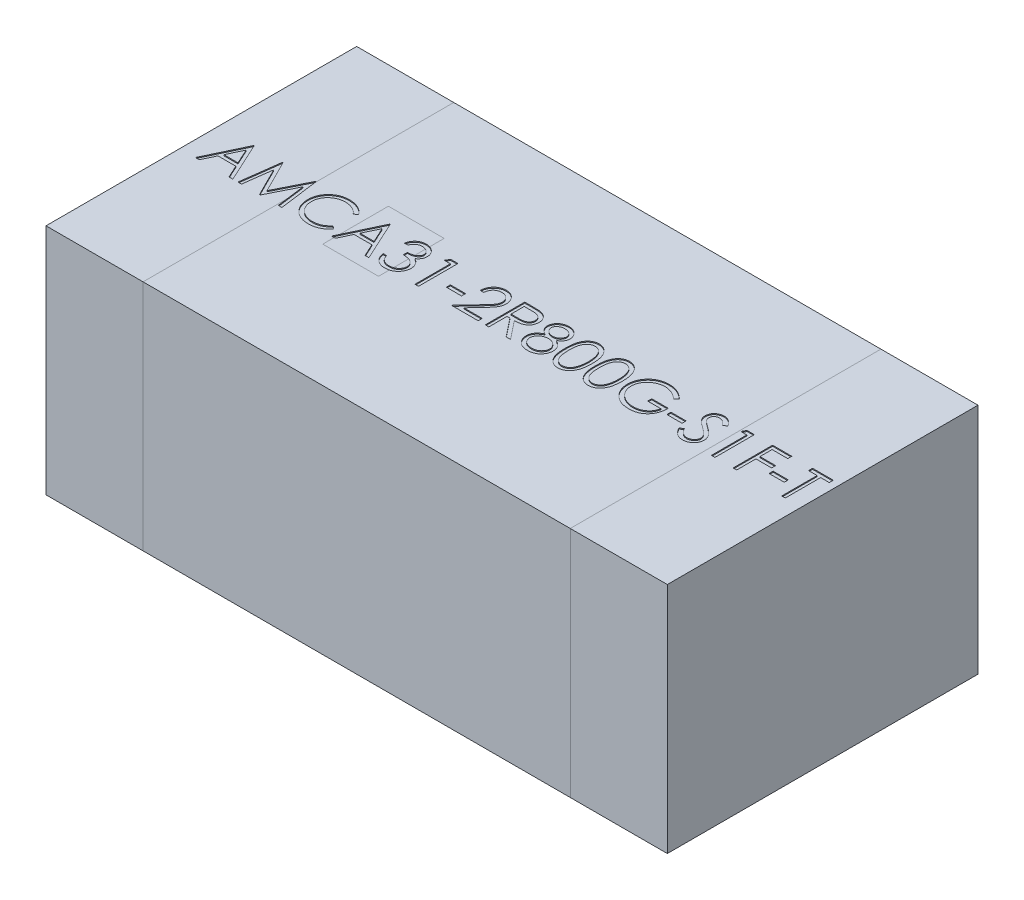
from build123d import *

# Parameters (mm, degrees)
SKETCH1_W           = 3.2
SKETCH1_H           = 1.6
BOSS_EXTRUDE1_DEPTH = 0.6
SKETCH18_W          = 0.078153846
SKETCH18_H          = 0.020841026
SKETCH18_W_2        = 0.078153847
CUT_EXTRUDE1_DEPTH  = 0.005


with BuildPart() as part:
    # Sketch1 → Boss-Extrude1 (new, symmetric)
    with BuildSketch(Plane(origin=(0, 0, 0), x_dir=(1, 0, 0), z_dir=(0, 1, 0))):
        Rectangle(SKETCH1_W, SKETCH1_H)
    extrude(amount=BOSS_EXTRUDE1_DEPTH, both=True)

    # Sketch18 → Cut-Extrude1 (cut)
    # profile 1 of 19: a face of its own
    with BuildSketch(Plane(origin=(0, 0.6, 0), x_dir=(1, 0, 0), z_dir=(0, 1, 0))):
        Polygon((-1.420786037, 0.092640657), (-1.327001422, -0.110559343), (-1.346824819, -0.110559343), (-1.376865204, -0.045431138), (-1.468980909, -0.045431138), (-1.499876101, -0.110559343), (-1.519780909, -0.110559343), (-1.423391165, 0.092640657), align=None)
        Polygon((-1.422292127, 0.053034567), (-1.459089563, -0.024590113), (-1.386471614, -0.024590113), align=None, mode=Mode.SUBTRACT)
    # profile 2 of 19: a face of its own
    with BuildSketch(Plane(origin=(0, 0.6, 0), x_dir=(1, 0, 0), z_dir=(0, 1, 0))):
        Polygon((-1.30095014, -0.110559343), (-1.27412546, 0.092640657), (-1.271520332, 0.092640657), (-1.187627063, -0.074087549), (-1.103937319, 0.092640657), (-1.101291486, 0.092640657), (-1.074303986, -0.110559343), (-1.092621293, -0.110559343), (-1.112078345, 0.035653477), (-1.185428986, -0.110559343), (-1.189540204, -0.110559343), (-1.263175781, 0.035979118), (-1.282592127, -0.110559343), align=None)
    # profile 3 of 19: a face of its own
    with BuildSketch(Plane(origin=(0, 0.6, 0), x_dir=(1, 0, 0), z_dir=(0, 1, 0))):
        with BuildLine():
            Line((-0.845052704, 0.055354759), (-0.861009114, 0.043143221))
            add(Edge.make_bspline(
                [(-0.861009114, 0.043143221), (-0.862147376, 0.044499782), (-0.864408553, 0.047194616), (-0.868046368, 0.050978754), (-0.871837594, 0.054524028), (-0.875780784, 0.057847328), (-0.879946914, 0.060832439), (-0.884235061, 0.063634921), (-0.888716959, 0.066146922), (-0.89491466, 0.069192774), (-0.903022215, 0.072371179), (-0.913228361, 0.075036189), (-0.923882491, 0.076732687), (-0.931151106, 0.076916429), (-0.934848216, 0.077009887)],
                knots=[0, 0, 0, 0, 0.757959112, 1.505699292, 2.245454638, 2.979532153, 3.711538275, 4.438200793, 5.171680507, 5.909471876, 7.393775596, 8.890124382, 10.418191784, 12, 12, 12, 12], degree=3))
            add(Edge.make_bspline(
                [(-0.934848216, 0.077009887), (-0.936885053, 0.076986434), (-0.940939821, 0.076939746), (-0.946957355, 0.076323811), (-0.952862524, 0.075458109), (-0.958651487, 0.074173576), (-0.964316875, 0.072549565), (-0.969895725, 0.070608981), (-0.975307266, 0.068208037), (-0.98062636, 0.065554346), (-0.98572257, 0.062557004), (-0.990544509, 0.059287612), (-0.995074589, 0.055782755), (-0.999316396, 0.052029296), (-1.003274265, 0.04804414), (-1.006919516, 0.043784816), (-1.010239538, 0.039264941), (-1.013300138, 0.034544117), (-1.016041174, 0.029636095), (-1.018336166, 0.024522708), (-1.020368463, 0.019291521), (-1.021976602, 0.013883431), (-1.023249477, 0.008336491), (-1.024127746, 0.002635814), (-1.024736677, -0.00320669), (-1.024783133, -0.007166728), (-1.02480655, -0.009162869)],
                knots=[0, 0, 0, 0, 1.054917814, 2.100044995, 3.131103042, 4.146048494, 5.169673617, 6.183595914, 7.203665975, 8.234915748, 9.262203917, 10.264457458, 11.251630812, 12.227803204, 13.197192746, 14.159520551, 15.12972552, 16.100847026, 17.073214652, 18.039054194, 19.002613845, 19.979014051, 20.95965708, 21.949030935, 22.966165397, 24, 24, 24, 24], degree=3))
            add(Edge.make_bspline(
                [(-1.02480655, -0.009162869), (-1.024733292, -0.012166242), (-1.024589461, -0.018062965), (-1.023309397, -0.026700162), (-1.021364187, -0.034974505), (-1.018448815, -0.042834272), (-1.014853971, -0.05037638), (-1.010311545, -0.057473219), (-1.005050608, -0.064232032), (-0.998996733, -0.070493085), (-0.992354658, -0.076212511), (-0.985228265, -0.081249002), (-0.977635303, -0.085447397), (-0.969659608, -0.088941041), (-0.961239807, -0.091626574), (-0.952391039, -0.093517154), (-0.94313255, -0.094750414), (-0.936806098, -0.094868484), (-0.933586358, -0.094928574)],
                knots=[0, 0, 0, 0, 1.029171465, 2.020641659, 2.987623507, 3.938342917, 4.889210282, 5.84687017, 6.821220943, 7.821438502, 8.827599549, 9.822697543, 10.807740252, 11.797342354, 12.80366471, 13.83203677, 14.896651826, 16, 16, 16, 16], degree=3))
            add(Edge.make_bspline(
                [(-0.933586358, -0.094928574), (-0.93003891, -0.094830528), (-0.923056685, -0.094637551), (-0.912817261, -0.093002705), (-0.903015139, -0.090351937), (-0.893649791, -0.086642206), (-0.884747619, -0.081819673), (-0.876294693, -0.075973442), (-0.868283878, -0.069047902), (-0.863466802, -0.063759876), (-0.861009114, -0.061061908)],
                knots=[0, 0, 0, 0, 1.028121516, 2.023589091, 2.998037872, 3.967518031, 4.937445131, 5.927275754, 6.942489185, 8, 8, 8, 8], degree=3))
            Line((-0.861009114, -0.061061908), (-0.845052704, -0.073151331))
            add(Edge.make_bspline(
                [(-0.845052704, -0.073151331), (-0.846336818, -0.074808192), (-0.848898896, -0.078113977), (-0.853047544, -0.082774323), (-0.857417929, -0.087157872), (-0.862042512, -0.091229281), (-0.866868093, -0.095070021), (-0.87198132, -0.098570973), (-0.877314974, -0.101781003), (-0.882850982, -0.104720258), (-0.888583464, -0.107328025), (-0.89450555, -0.109560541), (-0.900591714, -0.111483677), (-0.906842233, -0.113065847), (-0.913270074, -0.114300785), (-0.91985204, -0.115126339), (-0.926602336, -0.115691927), (-0.931156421, -0.115743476), (-0.933464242, -0.1157696)],
                knots=[0, 0, 0, 0, 0.986787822, 1.968848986, 2.935600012, 3.899624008, 4.868462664, 5.837806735, 6.815139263, 7.798259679, 8.787526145, 9.778297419, 10.776456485, 11.791383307, 12.812564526, 13.85620153, 14.913611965, 16, 16, 16, 16], degree=3))
            add(Edge.make_bspline(
                [(-0.933464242, -0.1157696), (-0.935649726, -0.115754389), (-0.939971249, -0.115724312), (-0.946351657, -0.115237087), (-0.952563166, -0.114572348), (-0.958588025, -0.113571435), (-0.96445911, -0.112390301), (-0.970123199, -0.11080701), (-0.975636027, -0.109033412), (-0.980975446, -0.106948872), (-0.986145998, -0.104596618), (-0.991131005, -0.101938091), (-0.995928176, -0.098995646), (-1.000584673, -0.095834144), (-1.00503171, -0.092352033), (-1.009307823, -0.088597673), (-1.013436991, -0.084583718), (-1.015991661, -0.081689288), (-1.017276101, -0.080234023)],
                knots=[0, 0, 0, 0, 1.114604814, 2.203992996, 3.262667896, 4.300477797, 5.318619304, 6.316056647, 7.298880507, 8.271930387, 9.238335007, 10.195173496, 11.151986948, 12.108099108, 13.064862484, 14.031167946, 15.010108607, 16, 16, 16, 16], degree=3))
            add(Edge.make_bspline(
                [(-1.017276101, -0.080234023), (-1.019333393, -0.077706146), (-1.02342314, -0.072680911), (-1.02865558, -0.064536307), (-1.033134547, -0.056032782), (-1.036755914, -0.047125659), (-1.039586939, -0.037834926), (-1.041548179, -0.0281559), (-1.042822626, -0.018097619), (-1.042968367, -0.011256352), (-1.043042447, -0.007778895)],
                knots=[0, 0, 0, 0, 0.994628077, 1.977248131, 2.950237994, 3.925870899, 4.908910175, 5.911660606, 6.938484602, 8, 8, 8, 8], degree=3))
            add(Edge.make_bspline(
                [(-1.043042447, -0.007778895), (-1.042952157, -0.004123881), (-1.042774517, 0.00306713), (-1.041265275, 0.013620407), (-1.038837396, 0.023731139), (-1.035388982, 0.033380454), (-1.031016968, 0.042619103), (-1.025616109, 0.051376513), (-1.019249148, 0.059708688), (-1.011966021, 0.067489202), (-1.003979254, 0.074603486), (-0.995426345, 0.080862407), (-0.986324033, 0.086071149), (-0.976772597, 0.090425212), (-0.966700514, 0.093771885), (-0.956129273, 0.096114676), (-0.94507874, 0.097572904), (-0.937539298, 0.097757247), (-0.933708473, 0.097850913)],
                knots=[0, 0, 0, 0, 1.032925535, 2.032216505, 3.007276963, 3.968222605, 4.92396291, 5.891752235, 6.871517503, 7.883894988, 8.900124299, 9.891468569, 10.874487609, 11.85992873, 12.854644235, 13.869047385, 14.917252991, 16, 16, 16, 16], degree=3))
            add(Edge.make_bspline(
                [(-0.933708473, 0.097850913), (-0.931373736, 0.097822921), (-0.926752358, 0.097767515), (-0.919915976, 0.097227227), (-0.91326017, 0.096326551), (-0.906780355, 0.095100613), (-0.900445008, 0.09357909), (-0.894302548, 0.091597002), (-0.888316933, 0.089330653), (-0.882525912, 0.086720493), (-0.876957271, 0.083790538), (-0.871612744, 0.080573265), (-0.866534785, 0.077072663), (-0.861687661, 0.073318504), (-0.857152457, 0.069231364), (-0.852800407, 0.064923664), (-0.848779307, 0.060271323), (-0.846297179, 0.056996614), (-0.845052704, 0.055354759)],
                knots=[0, 0, 0, 0, 1.096760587, 2.17092713, 3.219439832, 4.250915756, 5.268269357, 6.278326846, 7.281116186, 8.274029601, 9.260640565, 10.235837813, 11.203064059, 12.156899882, 13.114053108, 14.069676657, 15.032185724, 16, 16, 16, 16], degree=3))
        make_face()
    # profile 4 of 19: a face of its own
    with BuildSketch(Plane(origin=(0, 0.6, 0), x_dir=(1, 0, 0), z_dir=(0, 1, 0))):
        Polygon((-0.72000655, 0.092640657), (-0.626221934, -0.110559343), (-0.646045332, -0.110559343), (-0.676085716, -0.045431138), (-0.768201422, -0.045431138), (-0.799096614, -0.110559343), (-0.819001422, -0.110559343), (-0.722611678, 0.092640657), align=None)
        Polygon((-0.72151264, 0.053034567), (-0.758310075, -0.024590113), (-0.685692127, -0.024590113), align=None, mode=Mode.SUBTRACT)
    # profile 5 of 19: a face of its own
    with BuildSketch(Plane(origin=(0, 0.6, 0), x_dir=(1, 0, 0), z_dir=(0, 1, 0))):
        with BuildLine():
            Line((-0.581934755, 0.045748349), (-0.600170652, 0.045748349))
            add(Edge.make_bspline(
                [(-0.600170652, 0.045748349), (-0.599676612, 0.047793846), (-0.598710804, 0.051792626), (-0.596696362, 0.057505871), (-0.594501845, 0.062912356), (-0.591866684, 0.067910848), (-0.588992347, 0.072601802), (-0.585699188, 0.076878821), (-0.58213914, 0.080850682), (-0.578201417, 0.084375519), (-0.57407189, 0.087567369), (-0.569692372, 0.090288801), (-0.565150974, 0.092629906), (-0.560416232, 0.094558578), (-0.55547405, 0.096011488), (-0.550369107, 0.09706562), (-0.545088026, 0.097750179), (-0.541503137, 0.097816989), (-0.539682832, 0.097850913)],
                knots=[0, 0, 0, 0, 1.162005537, 2.271625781, 3.343758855, 4.383309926, 5.390229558, 6.379919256, 7.361854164, 8.333198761, 9.295911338, 10.242430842, 11.177959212, 12.116337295, 13.062827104, 14.020064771, 14.994644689, 16, 16, 16, 16], degree=3))
            add(Edge.make_bspline(
                [(-0.539682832, 0.097850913), (-0.537030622, 0.097770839), (-0.531784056, 0.097612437), (-0.524076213, 0.096165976), (-0.516643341, 0.093877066), (-0.5095668, 0.090714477), (-0.502993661, 0.086813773), (-0.497145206, 0.082171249), (-0.492100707, 0.076876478), (-0.487868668, 0.071028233), (-0.484555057, 0.064778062), (-0.482111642, 0.058345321), (-0.48062412, 0.051745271), (-0.480431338, 0.047288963), (-0.480334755, 0.045056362)],
                knots=[0, 0, 0, 0, 1.083050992, 2.142477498, 3.193116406, 4.255571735, 5.30263384, 6.308962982, 7.297363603, 8.282367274, 9.249857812, 10.179914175, 11.08814088, 12, 12, 12, 12], degree=3))
            add(Edge.make_bspline(
                [(-0.480334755, 0.045056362), (-0.48040231, 0.042907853), (-0.480534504, 0.038703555), (-0.481656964, 0.032565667), (-0.483545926, 0.02678076), (-0.486162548, 0.021324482), (-0.489549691, 0.016231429), (-0.493652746, 0.01149014), (-0.498500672, 0.007079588), (-0.502174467, 0.004552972), (-0.504065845, 0.003252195)],
                knots=[0, 0, 0, 0, 1.024540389, 2.004866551, 2.965041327, 3.920577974, 4.882998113, 5.874504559, 6.905732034, 8, 8, 8, 8], degree=3))
            add(Edge.make_bspline(
                [(-0.504065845, 0.003252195), (-0.501904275, 0.002208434), (-0.497621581, 0.000140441), (-0.491783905, -0.003915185), (-0.486484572, -0.008597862), (-0.483529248, -0.012252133), (-0.48204437, -0.01408819)],
                knots=[0, 0, 0, 0, 1.015518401, 2.012035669, 3.001164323, 4, 4, 4, 4], degree=3))
            add(Edge.make_bspline(
                [(-0.48204437, -0.01408819), (-0.48106661, -0.015426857), (-0.479127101, -0.018082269), (-0.476733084, -0.022351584), (-0.474561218, -0.026668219), (-0.472868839, -0.031147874), (-0.471558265, -0.035738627), (-0.470621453, -0.040448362), (-0.47003948, -0.045280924), (-0.469956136, -0.048550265), (-0.469914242, -0.050193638)],
                knots=[0, 0, 0, 0, 1.025084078, 2.033381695, 3.024893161, 4.013698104, 4.991890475, 5.976764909, 6.982997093, 8, 8, 8, 8], degree=3))
            add(Edge.make_bspline(
                [(-0.469914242, -0.050193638), (-0.470018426, -0.053039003), (-0.470226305, -0.058716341), (-0.47208437, -0.067104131), (-0.474964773, -0.07530328), (-0.479055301, -0.083145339), (-0.484040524, -0.090482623), (-0.489971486, -0.09704751), (-0.4967808, -0.102690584), (-0.504375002, -0.107405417), (-0.512602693, -0.111174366), (-0.521402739, -0.113790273), (-0.530648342, -0.115494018), (-0.536988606, -0.115676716), (-0.540211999, -0.1157696)],
                knots=[0, 0, 0, 0, 0.955779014, 1.907060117, 2.875433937, 3.871313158, 4.872415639, 5.851225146, 6.836215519, 7.83643374, 8.849228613, 9.86973379, 10.916971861, 12, 12, 12, 12], degree=3))
            add(Edge.make_bspline(
                [(-0.540211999, -0.1157696), (-0.542384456, -0.115719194), (-0.546659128, -0.115620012), (-0.552943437, -0.114941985), (-0.558941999, -0.113703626), (-0.564662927, -0.112037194), (-0.570111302, -0.109924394), (-0.575270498, -0.10729332), (-0.580172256, -0.104198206), (-0.584770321, -0.100602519), (-0.589064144, -0.096580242), (-0.592939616, -0.092059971), (-0.596461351, -0.087125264), (-0.599535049, -0.081718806), (-0.602300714, -0.075910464), (-0.604575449, -0.069625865), (-0.606577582, -0.062921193), (-0.607508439, -0.058248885), (-0.607986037, -0.055851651)],
                knots=[0, 0, 0, 0, 1.048658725, 2.063410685, 3.046034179, 4.001477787, 4.936774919, 5.862367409, 6.792675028, 7.730719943, 8.675894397, 9.627829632, 10.600096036, 11.597688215, 12.626045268, 13.701542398, 14.82072376, 16, 16, 16, 16], degree=3))
            Line((-0.607986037, -0.055851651), (-0.58975014, -0.055851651))
            add(Edge.make_bspline(
                [(-0.58975014, -0.055851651), (-0.589275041, -0.057416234), (-0.588350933, -0.060459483), (-0.586777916, -0.064839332), (-0.584985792, -0.068854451), (-0.583063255, -0.072534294), (-0.581044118, -0.075915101), (-0.578784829, -0.078907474), (-0.576452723, -0.081642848), (-0.57469479, -0.083183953), (-0.573834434, -0.08393819)],
                knots=[0, 0, 0, 0, 1.198163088, 2.33053128, 3.407730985, 4.417276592, 5.372219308, 6.28897303, 7.162600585, 8, 8, 8, 8], degree=3))
            add(Edge.make_bspline(
                [(-0.573834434, -0.08393819), (-0.572696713, -0.084815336), (-0.570424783, -0.086566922), (-0.566722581, -0.088802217), (-0.562828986, -0.090739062), (-0.558659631, -0.092218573), (-0.554304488, -0.09347131), (-0.549693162, -0.094291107), (-0.544866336, -0.094853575), (-0.541570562, -0.09490321), (-0.539886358, -0.094928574)],
                knots=[0, 0, 0, 0, 0.946170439, 1.889420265, 2.845303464, 3.807233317, 4.801018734, 5.828864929, 6.890507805, 8, 8, 8, 8], degree=3))
            add(Edge.make_bspline(
                [(-0.539886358, -0.094928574), (-0.537984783, -0.094892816), (-0.534266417, -0.094822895), (-0.528840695, -0.094179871), (-0.523678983, -0.093243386), (-0.518838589, -0.091797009), (-0.514256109, -0.090009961), (-0.50999578, -0.087766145), (-0.506001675, -0.08513356), (-0.502324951, -0.082141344), (-0.499018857, -0.078865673), (-0.4961079, -0.075439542), (-0.493633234, -0.071877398), (-0.491637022, -0.068159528), (-0.490060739, -0.064301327), (-0.488987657, -0.060291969), (-0.488241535, -0.056164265), (-0.488180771, -0.053358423), (-0.48815014, -0.051943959)],
                knots=[0, 0, 0, 0, 1.217147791, 2.380027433, 3.494444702, 4.572153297, 5.609568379, 6.639424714, 7.649109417, 8.668170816, 9.669597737, 10.625200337, 11.543417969, 12.441394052, 13.322311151, 14.205496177, 15.095365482, 16, 16, 16, 16], degree=3))
            add(Edge.make_bspline(
                [(-0.48815014, -0.051943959), (-0.488238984, -0.050050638), (-0.488416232, -0.046273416), (-0.489769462, -0.040716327), (-0.491995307, -0.035362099), (-0.495111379, -0.030302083), (-0.498904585, -0.025612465), (-0.503338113, -0.021428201), (-0.508448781, -0.017975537), (-0.513152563, -0.015590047), (-0.517319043, -0.013962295), (-0.520884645, -0.01287808), (-0.524876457, -0.011959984), (-0.529246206, -0.011105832), (-0.534026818, -0.010378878), (-0.539213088, -0.009772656), (-0.544806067, -0.009287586), (-0.548677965, -0.009070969), (-0.550673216, -0.008959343)],
                knots=[0, 0, 0, 0, 1.07054697, 2.135767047, 3.216561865, 4.33974944, 5.486079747, 6.621378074, 7.775625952, 8.963672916, 9.598146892, 10.304877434, 11.070270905, 11.915000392, 12.823868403, 13.805723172, 14.86925407, 16, 16, 16, 16], degree=3))
            Line((-0.550673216, -0.008959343), (-0.550673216, 0.011881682))
            add(Edge.make_bspline(
                [(-0.550673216, 0.011881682), (-0.548159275, 0.011924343), (-0.54323508, 0.012007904), (-0.53604213, 0.013018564), (-0.529163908, 0.014416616), (-0.522752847, 0.016558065), (-0.516909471, 0.01904525), (-0.511839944, 0.021939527), (-0.507615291, 0.025156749), (-0.504256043, 0.028746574), (-0.50172886, 0.032596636), (-0.499881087, 0.036609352), (-0.498789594, 0.040819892), (-0.49864389, 0.043693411), (-0.498570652, 0.045137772)],
                knots=[0, 0, 0, 0, 1.321986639, 2.589447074, 3.816329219, 5.01088745, 6.139805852, 7.153945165, 8.075214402, 8.924034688, 9.728124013, 10.488707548, 11.240355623, 12, 12, 12, 12], degree=3))
            add(Edge.make_bspline(
                [(-0.498570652, 0.045137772), (-0.498594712, 0.046198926), (-0.498642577, 0.048310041), (-0.499246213, 0.05139433), (-0.500153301, 0.054384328), (-0.501400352, 0.057267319), (-0.503069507, 0.060023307), (-0.50506702, 0.06267579), (-0.507445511, 0.065209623), (-0.510171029, 0.067571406), (-0.513097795, 0.069822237), (-0.516305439, 0.071733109), (-0.519697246, 0.073367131), (-0.523276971, 0.074714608), (-0.527056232, 0.075728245), (-0.531017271, 0.07645604), (-0.535167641, 0.076911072), (-0.537999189, 0.076976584), (-0.539438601, 0.077009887)],
                knots=[0, 0, 0, 0, 0.884392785, 1.759457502, 2.611959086, 3.489218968, 4.37281399, 5.2945488, 6.255912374, 7.266815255, 8.301784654, 9.332968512, 10.37626691, 11.440494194, 12.520033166, 13.637162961, 14.798855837, 16, 16, 16, 16], degree=3))
            add(Edge.make_bspline(
                [(-0.539438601, 0.077009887), (-0.541752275, 0.076929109), (-0.546271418, 0.07677133), (-0.552786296, 0.075389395), (-0.558842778, 0.073184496), (-0.563472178, 0.07055259), (-0.566890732, 0.067954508), (-0.569333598, 0.065685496), (-0.571732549, 0.06316391), (-0.573929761, 0.060234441), (-0.576151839, 0.057095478), (-0.578174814, 0.053587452), (-0.580140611, 0.049801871), (-0.581325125, 0.04712569), (-0.581934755, 0.045748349)],
                knots=[0, 0, 0, 0, 1.472543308, 2.876219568, 4.221790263, 5.565193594, 6.249813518, 6.953379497, 7.687249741, 8.463570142, 9.283606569, 10.136032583, 11.040678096, 12, 12, 12, 12], degree=3))
        make_face()
    # profile 6 of 19: a face of its own
    with BuildSketch(Plane(origin=(0, 0.6, 0), x_dir=(1, 0, 0), z_dir=(0, 1, 0))):
        Polygon((-0.408490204, 0.092640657), (-0.37091937, 0.092640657), (-0.37091937, -0.110559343), (-0.389155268, -0.110559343), (-0.389155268, 0.071799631), (-0.420416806, 0.071799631), align=None)
    # profile 7 of 19: a face of its own
    with BuildSketch(Plane(origin=(0, 0.6, 0), x_dir=(1, 0, 0), z_dir=(0, 1, 0))):
        with Locations((-0.256293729, -0.032405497)):
            Rectangle(SKETCH18_W, SKETCH18_H)
    # profile 8 of 19: a face of its own
    with BuildSketch(Plane(origin=(0, 0.6, 0), x_dir=(1, 0, 0), z_dir=(0, 1, 0))):
        with BuildLine():
            Line((-0.175534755, 0.03011758), (-0.193770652, 0.03011758))
            add(Edge.make_bspline(
                [(-0.193770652, 0.03011758), (-0.193651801, 0.032536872), (-0.193418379, 0.037288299), (-0.192325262, 0.044215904), (-0.190761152, 0.0508376), (-0.188549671, 0.057100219), (-0.185803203, 0.063059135), (-0.18250962, 0.068690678), (-0.178608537, 0.073973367), (-0.174184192, 0.078858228), (-0.169378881, 0.083339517), (-0.164194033, 0.08720933), (-0.158745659, 0.090478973), (-0.153050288, 0.093212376), (-0.147043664, 0.095264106), (-0.140780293, 0.09678646), (-0.134232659, 0.097702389), (-0.129771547, 0.097800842), (-0.127502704, 0.097850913)],
                knots=[0, 0, 0, 0, 1.10065271, 2.161652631, 3.183658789, 4.190468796, 5.17591951, 6.163126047, 7.15150782, 8.156236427, 9.156009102, 10.134482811, 11.092018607, 12.041330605, 13.001268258, 13.972401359, 14.968799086, 16, 16, 16, 16], degree=3))
            add(Edge.make_bspline(
                [(-0.127502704, 0.097850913), (-0.125274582, 0.097798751), (-0.120896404, 0.097696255), (-0.114506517, 0.096816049), (-0.108423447, 0.095437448), (-0.102659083, 0.09350325), (-0.097259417, 0.090903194), (-0.092183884, 0.087779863), (-0.087372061, 0.084167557), (-0.083040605, 0.07991465), (-0.079063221, 0.075374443), (-0.075631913, 0.070527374), (-0.072693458, 0.065521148), (-0.070244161, 0.060317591), (-0.068441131, 0.054867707), (-0.067072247, 0.049250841), (-0.066298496, 0.043408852), (-0.066179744, 0.03945478), (-0.06611937, 0.037444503)],
                knots=[0, 0, 0, 0, 1.111607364, 2.184268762, 3.212621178, 4.221274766, 5.211760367, 6.196651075, 7.1921475, 8.207485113, 9.220403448, 10.201281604, 11.166441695, 12.114753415, 13.065576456, 14.026450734, 14.996634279, 16, 16, 16, 16], degree=3))
            add(Edge.make_bspline(
                [(-0.06611937, 0.037444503), (-0.066217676, 0.034614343), (-0.066412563, 0.029003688), (-0.068079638, 0.020758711), (-0.070683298, 0.01277043), (-0.07381823, 0.006341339), (-0.076980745, 0.001160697), (-0.079830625, -0.003104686), (-0.083166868, -0.007697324), (-0.087038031, -0.012601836), (-0.091364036, -0.017856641), (-0.096184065, -0.023458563), (-0.101532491, -0.029349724), (-0.105286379, -0.033373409), (-0.10723155, -0.035458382)],
                knots=[0, 0, 0, 0, 1.184426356, 2.348067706, 3.509069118, 4.696110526, 5.333549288, 6.050745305, 6.844228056, 7.710549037, 8.667450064, 9.695053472, 10.805634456, 12, 12, 12, 12], degree=3))
            Line((-0.10723155, -0.035458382), (-0.158072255, -0.089718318))
            Line((-0.158072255, -0.089718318), (-0.063514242, -0.089718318))
            Line((-0.063514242, -0.089718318), (-0.063514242, -0.110559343))
            Line((-0.063514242, -0.110559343), (-0.201586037, -0.110559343))
            Line((-0.201586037, -0.110559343), (-0.122780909, -0.026462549))
            add(Edge.make_bspline(
                [(-0.122780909, -0.026462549), (-0.120862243, -0.024459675), (-0.117176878, -0.020612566), (-0.111964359, -0.014995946), (-0.107282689, -0.009785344), (-0.103101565, -0.004990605), (-0.099511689, -0.000541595), (-0.096325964, 0.003417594), (-0.093773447, 0.007060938), (-0.091003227, 0.011284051), (-0.088320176, 0.01644024), (-0.08601459, 0.022741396), (-0.084608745, 0.029227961), (-0.084440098, 0.033611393), (-0.084355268, 0.035816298)],
                knots=[0, 0, 0, 0, 1.329631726, 2.553950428, 3.673215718, 4.687767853, 5.603093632, 6.413772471, 7.123043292, 7.734684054, 8.834405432, 9.900288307, 10.943827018, 12, 12, 12, 12], degree=3))
            add(Edge.make_bspline(
                [(-0.084355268, 0.035816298), (-0.084392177, 0.037202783), (-0.084464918, 0.039935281), (-0.085106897, 0.043941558), (-0.086077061, 0.047806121), (-0.087467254, 0.051540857), (-0.089302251, 0.055108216), (-0.091535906, 0.05851254), (-0.094113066, 0.061803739), (-0.097094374, 0.064889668), (-0.100369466, 0.06771596), (-0.103829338, 0.070219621), (-0.107489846, 0.072311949), (-0.111335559, 0.07402716), (-0.115355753, 0.075372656), (-0.119558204, 0.076304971), (-0.123931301, 0.076890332), (-0.126917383, 0.076969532), (-0.128438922, 0.077009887)],
                knots=[0, 0, 0, 0, 0.991446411, 1.95395049, 2.89581595, 3.838931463, 4.798493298, 5.75982156, 6.748411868, 7.785213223, 8.824556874, 9.840280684, 10.836137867, 11.835679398, 12.848801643, 13.863922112, 14.911575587, 16, 16, 16, 16], degree=3))
            add(Edge.make_bspline(
                [(-0.128438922, 0.077009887), (-0.130027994, 0.076968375), (-0.13314867, 0.07688685), (-0.137730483, 0.076316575), (-0.14210136, 0.075332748), (-0.146272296, 0.073987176), (-0.150250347, 0.072276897), (-0.154016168, 0.070146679), (-0.157561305, 0.067604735), (-0.160892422, 0.064722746), (-0.163961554, 0.061514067), (-0.166658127, 0.057937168), (-0.169014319, 0.054057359), (-0.171070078, 0.049885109), (-0.172739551, 0.045382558), (-0.174015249, 0.04056569), (-0.17502468, 0.03545542), (-0.175361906, 0.031926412), (-0.175534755, 0.03011758)],
                knots=[0, 0, 0, 0, 1.031018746, 2.02475058, 2.990194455, 3.934040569, 4.864654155, 5.795059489, 6.735614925, 7.690564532, 8.649604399, 9.611025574, 10.590972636, 11.591080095, 12.624614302, 13.701020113, 14.821632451, 16, 16, 16, 16], degree=3))
        make_face()
    # profile 9 of 19: a face of its own
    with BuildSketch(Plane(origin=(0, 0.6, 0), x_dir=(1, 0, 0), z_dir=(0, 1, 0))):
        with BuildLine():
            Line((-0.027042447, 0.092640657), (0.013621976, 0.092640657))
            add(Edge.make_bspline(
                [(0.013621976, 0.092640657), (0.016335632, 0.092631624), (0.021546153, 0.09261428), (0.02901075, 0.09251757), (0.035793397, 0.092240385), (0.041890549, 0.092001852), (0.047302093, 0.091566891), (0.052044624, 0.091151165), (0.056096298, 0.090606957), (0.058548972, 0.090101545), (0.059659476, 0.089872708)],
                knots=[0, 0, 0, 0, 1.410062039, 2.707475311, 3.878576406, 4.937260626, 5.877586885, 6.699081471, 7.410979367, 8, 8, 8, 8], degree=3))
            add(Edge.make_bspline(
                [(0.059659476, 0.089872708), (0.061146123, 0.089505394), (0.064087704, 0.088778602), (0.068322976, 0.087242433), (0.072358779, 0.085464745), (0.076178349, 0.083376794), (0.079762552, 0.080963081), (0.083148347, 0.078265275), (0.086351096, 0.075298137), (0.089241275, 0.071986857), (0.091966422, 0.06851292), (0.094264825, 0.064756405), (0.096246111, 0.06082817), (0.097823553, 0.056688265), (0.099093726, 0.052376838), (0.099989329, 0.047854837), (0.100526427, 0.043142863), (0.100581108, 0.039928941), (0.100608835, 0.03829931)],
                knots=[0, 0, 0, 0, 1.027469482, 2.033020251, 3.019912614, 3.986113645, 4.951240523, 5.91722682, 6.890402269, 7.87763091, 8.8651537, 9.85103654, 10.82876324, 11.815024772, 12.821070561, 13.842952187, 14.906261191, 16, 16, 16, 16], degree=3))
            add(Edge.make_bspline(
                [(0.100608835, 0.03829931), (0.100523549, 0.03559181), (0.100357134, 0.030308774), (0.098805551, 0.022641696), (0.096264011, 0.015489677), (0.092761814, 0.00886172), (0.088301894, 0.002887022), (0.082941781, -0.002360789), (0.076678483, -0.006752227), (0.070847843, -0.009797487), (0.06569735, -0.011747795), (0.061457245, -0.013120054), (0.056832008, -0.014180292), (0.051865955, -0.015130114), (0.046538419, -0.015847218), (0.04086217, -0.016372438), (0.034833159, -0.016700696), (0.030691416, -0.01674958), (0.028560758, -0.016774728)],
                knots=[0, 0, 0, 0, 1.260483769, 2.459530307, 3.627416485, 4.787058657, 5.939039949, 7.08810263, 8.267026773, 9.491475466, 10.141966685, 10.831826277, 11.566392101, 12.351337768, 13.187381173, 14.07005841, 15.007169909, 16, 16, 16, 16], degree=3))
            Line((0.028560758, -0.016774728), (0.103213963, -0.110559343))
            Line((0.103213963, -0.110559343), (0.080663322, -0.110559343))
            Line((0.080663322, -0.110559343), (0.006010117, -0.016774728))
            Line((0.006010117, -0.016774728), (-0.00880655, -0.016774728))
            Line((-0.00880655, -0.016774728), (-0.00880655, -0.110559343))
            Line((-0.00880655, -0.110559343), (-0.027042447, -0.110559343))
            Line((-0.027042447, -0.110559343), (-0.027042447, 0.092640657))
        make_face()
        with BuildLine():
            Line((-0.00880655, 0.071799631), (-0.00880655, 0.004066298))
            Line((-0.00880655, 0.004066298), (0.028397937, 0.003781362))
            add(Edge.make_bspline(
                [(0.028397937, 0.003781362), (0.030135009, 0.003780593), (0.03350195, 0.003779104), (0.038372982, 0.004010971), (0.042908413, 0.004274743), (0.047090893, 0.004678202), (0.050922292, 0.005198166), (0.054400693, 0.005848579), (0.057531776, 0.006606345), (0.061183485, 0.007779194), (0.065261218, 0.009637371), (0.069692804, 0.012340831), (0.073466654, 0.015741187), (0.076655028, 0.019629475), (0.079217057, 0.023904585), (0.081023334, 0.028515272), (0.082169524, 0.033345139), (0.082304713, 0.036664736), (0.082372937, 0.038340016)],
                knots=[0, 0, 0, 0, 1.146690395, 2.22261258, 3.21895312, 4.145990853, 4.996080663, 5.770904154, 6.481378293, 7.121626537, 8.300444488, 9.431385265, 10.535395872, 11.636531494, 12.74115979, 13.810798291, 14.895190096, 16, 16, 16, 16], degree=3))
            add(Edge.make_bspline(
                [(0.082372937, 0.038340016), (0.082303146, 0.039974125), (0.082164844, 0.043212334), (0.081035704, 0.047953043), (0.07912624, 0.05242733), (0.076553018, 0.056616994), (0.073417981, 0.06042007), (0.06974193, 0.063674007), (0.065625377, 0.066359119), (0.061777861, 0.068074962), (0.058338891, 0.069126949), (0.055353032, 0.069867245), (0.051979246, 0.07046201), (0.048201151, 0.070938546), (0.044034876, 0.071348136), (0.039459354, 0.071624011), (0.034504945, 0.071787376), (0.031071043, 0.071795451), (0.02929345, 0.071799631)],
                knots=[0, 0, 0, 0, 1.101028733, 2.181837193, 3.264309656, 4.369019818, 5.486613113, 6.575447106, 7.666700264, 8.788928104, 9.402425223, 10.0903467, 10.862060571, 11.710948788, 12.657782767, 13.684531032, 14.801375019, 16, 16, 16, 16], degree=3))
            Line((0.02929345, 0.071799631), (-0.00880655, 0.071799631))
        make_face(mode=Mode.SUBTRACT)
    # profile 10 of 19: a face of its own
    with BuildSketch(Plane(origin=(0, 0.6, 0), x_dir=(1, 0, 0), z_dir=(0, 1, 0))):
        with BuildLine():
            add(Edge.make_bspline(
                [(0.225451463, 0.002641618), (0.227114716, 0.001774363), (0.230358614, 8.2926e-05), (0.23497864, -0.002640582), (0.239200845, -0.005510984), (0.243142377, -0.0083927), (0.246733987, -0.011396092), (0.249935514, -0.014533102), (0.252826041, -0.017725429), (0.255347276, -0.02102713), (0.257564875, -0.024429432), (0.259481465, -0.027941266), (0.261119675, -0.031554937), (0.262418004, -0.035309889), (0.26348752, -0.039150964), (0.26422343, -0.043127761), (0.264619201, -0.047214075), (0.264694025, -0.049975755), (0.264731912, -0.051374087)],
                knots=[0, 0, 0, 0, 1.272397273, 2.481599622, 3.635517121, 4.734568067, 5.792894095, 6.808321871, 7.773003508, 8.711915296, 9.623354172, 10.525449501, 11.423591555, 12.311487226, 13.218079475, 14.126165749, 15.051214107, 16, 16, 16, 16], degree=3))
            add(Edge.make_bspline(
                [(0.264731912, -0.051374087), (0.264687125, -0.053330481), (0.264598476, -0.057202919), (0.263826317, -0.062918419), (0.262670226, -0.068469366), (0.260981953, -0.073854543), (0.258792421, -0.079044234), (0.256094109, -0.084042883), (0.253039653, -0.088932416), (0.250586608, -0.091940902), (0.249345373, -0.09346319)],
                knots=[0, 0, 0, 0, 1.025265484, 2.029385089, 3.018602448, 3.995076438, 4.983346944, 5.966715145, 6.97116228, 8, 8, 8, 8], degree=3))
            add(Edge.make_bspline(
                [(0.249345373, -0.09346319), (0.247729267, -0.095239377), (0.244517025, -0.098769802), (0.239014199, -0.103353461), (0.232974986, -0.107205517), (0.226422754, -0.110344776), (0.219375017, -0.112788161), (0.211833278, -0.114543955), (0.203782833, -0.115549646), (0.19824967, -0.115695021), (0.195411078, -0.1157696)],
                knots=[0, 0, 0, 0, 0.954267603, 1.896743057, 2.838368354, 3.796610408, 4.779680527, 5.799409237, 6.871065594, 8, 8, 8, 8], degree=3))
            add(Edge.make_bspline(
                [(0.195411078, -0.1157696), (0.192681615, -0.11570269), (0.187370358, -0.115572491), (0.179639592, -0.114690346), (0.172433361, -0.113144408), (0.165709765, -0.111028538), (0.159509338, -0.108276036), (0.153849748, -0.104850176), (0.148649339, -0.100888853), (0.144065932, -0.096278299), (0.139996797, -0.091340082), (0.136422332, -0.086245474), (0.133451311, -0.080994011), (0.130935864, -0.075663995), (0.129010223, -0.070180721), (0.127676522, -0.064572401), (0.126829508, -0.058848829), (0.126716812, -0.054986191), (0.126660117, -0.053042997)],
                knots=[0, 0, 0, 0, 1.256902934, 2.445805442, 3.576955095, 4.645999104, 5.686449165, 6.692658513, 7.68621702, 8.689161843, 9.678783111, 10.630372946, 11.551080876, 12.453998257, 13.34127905, 14.221779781, 15.105423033, 16, 16, 16, 16], degree=3))
            add(Edge.make_bspline(
                [(0.126660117, -0.053042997), (0.126693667, -0.051617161), (0.126759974, -0.048799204), (0.127218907, -0.044635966), (0.127956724, -0.040583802), (0.128958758, -0.036627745), (0.130316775, -0.032796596), (0.131956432, -0.029072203), (0.133868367, -0.02545036), (0.136079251, -0.021911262), (0.1386513, -0.018504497), (0.141563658, -0.01517225), (0.144874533, -0.011966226), (0.148547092, -0.008847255), (0.152539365, -0.00576001), (0.156955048, -0.002871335), (0.161677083, 2.3276e-05), (0.1650331, 0.001753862), (0.166754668, 0.002641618)],
                knots=[0, 0, 0, 0, 0.941657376, 1.861047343, 2.762797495, 3.66048619, 4.553285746, 5.444104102, 6.34607688, 7.256116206, 8.197091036, 9.162375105, 10.176350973, 11.237807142, 12.343728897, 13.50695164, 14.721116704, 16, 16, 16, 16], degree=3))
            add(Edge.make_bspline(
                [(0.166754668, 0.002641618), (0.164398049, 0.0039267), (0.159834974, 0.006414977), (0.153793, 0.010986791), (0.148603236, 0.015938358), (0.144408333, 0.021374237), (0.141106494, 0.027124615), (0.138841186, 0.033153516), (0.137308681, 0.039349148), (0.137156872, 0.043581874), (0.13708063, 0.045707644)],
                knots=[0, 0, 0, 0, 1.166880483, 2.259407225, 3.286803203, 4.280235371, 5.237608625, 6.161067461, 7.076446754, 8, 8, 8, 8], degree=3))
            add(Edge.make_bspline(
                [(0.13708063, 0.045707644), (0.137175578, 0.047873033), (0.13736644, 0.052225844), (0.138909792, 0.058705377), (0.141424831, 0.065069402), (0.144845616, 0.071287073), (0.149106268, 0.077147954), (0.154217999, 0.082404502), (0.160058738, 0.0870091), (0.166599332, 0.090874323), (0.173637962, 0.094020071), (0.181064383, 0.096190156), (0.188749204, 0.097608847), (0.19398002, 0.097769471), (0.196632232, 0.097850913)],
                knots=[0, 0, 0, 0, 0.888701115, 1.786444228, 2.72001202, 3.692817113, 4.693886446, 5.687152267, 6.695133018, 7.739871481, 8.800368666, 9.853104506, 10.91144658, 12, 12, 12, 12], degree=3))
            add(Edge.make_bspline(
                [(0.196632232, 0.097850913), (0.199215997, 0.097766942), (0.204310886, 0.097601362), (0.211799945, 0.096220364), (0.218965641, 0.093913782), (0.225783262, 0.090784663), (0.232130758, 0.086930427), (0.237739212, 0.082262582), (0.242693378, 0.077029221), (0.246791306, 0.071170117), (0.250168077, 0.064976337), (0.252519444, 0.058495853), (0.254026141, 0.051868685), (0.254216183, 0.047384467), (0.254311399, 0.045137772)],
                knots=[0, 0, 0, 0, 1.072916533, 2.115669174, 3.151510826, 4.193348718, 5.225979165, 6.227137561, 7.216255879, 8.211077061, 9.189680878, 10.138522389, 11.067357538, 12, 12, 12, 12], degree=3))
            add(Edge.make_bspline(
                [(0.254311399, 0.045137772), (0.254228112, 0.042932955), (0.254064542, 0.038602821), (0.252688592, 0.03229047), (0.250371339, 0.026378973), (0.247207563, 0.020801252), (0.243084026, 0.015658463), (0.238055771, 0.01088521), (0.232162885, 0.006442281), (0.227735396, 0.003935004), (0.225451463, 0.002641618)],
                knots=[0, 0, 0, 0, 0.975232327, 1.915300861, 2.843280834, 3.77672583, 4.742871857, 5.749627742, 6.839139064, 8, 8, 8, 8], degree=3))
        make_face()
        with BuildLine():
            add(Edge.make_bspline(
                [(0.195614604, 0.077009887), (0.194189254, 0.076972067), (0.191400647, 0.076898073), (0.18731176, 0.076511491), (0.183423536, 0.075759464), (0.17969535, 0.074758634), (0.176178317, 0.0734066), (0.172824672, 0.071816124), (0.169691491, 0.069882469), (0.166740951, 0.067713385), (0.164084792, 0.065327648), (0.161727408, 0.062842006), (0.15976925, 0.06020764), (0.158106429, 0.05749008), (0.156899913, 0.054608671), (0.155996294, 0.051651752), (0.155385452, 0.048581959), (0.155339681, 0.046483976), (0.155316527, 0.045422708)],
                knots=[0, 0, 0, 0, 1.203892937, 2.355340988, 3.463153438, 4.544400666, 5.610487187, 6.640501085, 7.674077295, 8.714426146, 9.728707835, 10.68524104, 11.601827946, 12.495867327, 13.368432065, 14.231010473, 15.105153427, 16, 16, 16, 16], degree=3))
            add(Edge.make_bspline(
                [(0.155316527, 0.045422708), (0.155356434, 0.044361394), (0.155435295, 0.042264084), (0.156045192, 0.039166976), (0.156954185, 0.036123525), (0.158385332, 0.033206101), (0.16010187, 0.030313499), (0.162220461, 0.027518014), (0.16474531, 0.024809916), (0.167591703, 0.02221224), (0.170692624, 0.019779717), (0.173977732, 0.017667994), (0.177405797, 0.015901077), (0.180941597, 0.014430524), (0.184621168, 0.013287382), (0.188421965, 0.012476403), (0.192344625, 0.011972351), (0.195002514, 0.011912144), (0.196347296, 0.011881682)],
                knots=[0, 0, 0, 0, 0.873023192, 1.725219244, 2.590779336, 3.480155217, 4.391973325, 5.357036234, 6.360879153, 7.436073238, 8.526419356, 9.601555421, 10.645666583, 11.697338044, 12.750135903, 13.812665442, 14.89329948, 16, 16, 16, 16], degree=3))
            add(Edge.make_bspline(
                [(0.196347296, 0.011881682), (0.198074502, 0.011932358), (0.201511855, 0.01203321), (0.206579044, 0.012970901), (0.211505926, 0.014445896), (0.216239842, 0.016463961), (0.220658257, 0.018996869), (0.224596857, 0.022029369), (0.228022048, 0.025491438), (0.230898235, 0.02932918), (0.233128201, 0.033413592), (0.234864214, 0.037512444), (0.235877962, 0.041669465), (0.236010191, 0.04445429), (0.236075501, 0.045829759)],
                knots=[0, 0, 0, 0, 1.076279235, 2.141928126, 3.20205304, 4.278698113, 5.344010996, 6.36967002, 7.368914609, 8.37248503, 9.349703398, 10.264243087, 11.142681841, 12, 12, 12, 12], degree=3))
            add(Edge.make_bspline(
                [(0.236075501, 0.045829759), (0.236044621, 0.046795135), (0.235983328, 0.048711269), (0.235478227, 0.051540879), (0.234643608, 0.054306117), (0.233513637, 0.057029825), (0.232026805, 0.05967379), (0.230263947, 0.062279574), (0.228122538, 0.064788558), (0.22571918, 0.067259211), (0.222993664, 0.069545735), (0.219951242, 0.071556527), (0.216607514, 0.073264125), (0.212962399, 0.074651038), (0.209029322, 0.075692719), (0.204826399, 0.076472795), (0.200318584, 0.076912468), (0.197216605, 0.07697671), (0.195614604, 0.077009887)],
                knots=[0, 0, 0, 0, 0.814439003, 1.616544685, 2.417341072, 3.248991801, 4.09997495, 4.973547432, 5.9003056, 6.880240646, 7.880314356, 8.896779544, 9.951930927, 11.043077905, 12.18215768, 13.381699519, 14.647792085, 16, 16, 16, 16], degree=3))
        make_face(mode=Mode.SUBTRACT)
        with BuildLine():
            add(Edge.make_bspline(
                [(0.196795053, -0.008959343), (0.194987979, -0.008991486), (0.19144294, -0.009054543), (0.186249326, -0.009756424), (0.181264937, -0.010733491), (0.176506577, -0.012215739), (0.171976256, -0.014143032), (0.16764945, -0.016461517), (0.163559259, -0.01920213), (0.159762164, -0.022330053), (0.156294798, -0.025700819), (0.153252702, -0.029269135), (0.150669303, -0.032968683), (0.148588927, -0.036846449), (0.146881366, -0.040820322), (0.145760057, -0.044989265), (0.145041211, -0.049273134), (0.144944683, -0.052185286), (0.144896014, -0.053653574)],
                knots=[0, 0, 0, 0, 1.140299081, 2.23698856, 3.303958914, 4.344563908, 5.37730929, 6.408454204, 7.439741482, 8.480804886, 9.510774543, 10.48932336, 11.43758569, 12.353841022, 13.263987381, 14.161954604, 15.073269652, 16, 16, 16, 16], degree=3))
            add(Edge.make_bspline(
                [(0.144896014, -0.053653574), (0.144975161, -0.055478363), (0.145132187, -0.059098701), (0.146377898, -0.064449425), (0.148377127, -0.069629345), (0.151165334, -0.074596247), (0.154617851, -0.079237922), (0.158863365, -0.083283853), (0.163638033, -0.086878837), (0.169103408, -0.08978637), (0.175073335, -0.092108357), (0.181546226, -0.093708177), (0.188429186, -0.094767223), (0.19318172, -0.094873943), (0.195614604, -0.094928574)],
                knots=[0, 0, 0, 0, 0.898778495, 1.783155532, 2.693654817, 3.627872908, 4.583023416, 5.533784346, 6.509005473, 7.520592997, 8.575161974, 9.658835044, 10.801527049, 12, 12, 12, 12], degree=3))
            add(Edge.make_bspline(
                [(0.195614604, -0.094928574), (0.197515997, -0.094892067), (0.20122052, -0.09482094), (0.206624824, -0.094193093), (0.211724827, -0.093197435), (0.21651064, -0.091749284), (0.221035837, -0.089981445), (0.225223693, -0.087707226), (0.229181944, -0.085120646), (0.232715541, -0.082051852), (0.235933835, -0.078772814), (0.238739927, -0.075301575), (0.241175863, -0.071732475), (0.24308774, -0.067984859), (0.244616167, -0.064130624), (0.245714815, -0.060134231), (0.246392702, -0.055983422), (0.246461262, -0.053167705), (0.246496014, -0.051740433)],
                knots=[0, 0, 0, 0, 1.224942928, 2.386581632, 3.501229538, 4.569074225, 5.605009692, 6.626002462, 7.634866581, 8.645888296, 9.63523824, 10.59253846, 11.518950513, 12.414518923, 13.29783783, 14.186679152, 15.080837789, 16, 16, 16, 16], degree=3))
            add(Edge.make_bspline(
                [(0.246496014, -0.051740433), (0.246443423, -0.050354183), (0.246339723, -0.04762074), (0.245681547, -0.043570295), (0.244525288, -0.03965708), (0.242938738, -0.035834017), (0.240826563, -0.032178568), (0.238339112, -0.028595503), (0.235337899, -0.025184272), (0.231946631, -0.021918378), (0.228250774, -0.018898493), (0.224322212, -0.016227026), (0.220191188, -0.013977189), (0.215866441, -0.012147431), (0.211357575, -0.010708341), (0.206667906, -0.009703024), (0.201791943, -0.009070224), (0.1984795, -0.008996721), (0.196795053, -0.008959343)],
                knots=[0, 0, 0, 0, 0.917430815, 1.809013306, 2.70690318, 3.612392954, 4.541220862, 5.495268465, 6.494511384, 7.542276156, 8.608045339, 9.649016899, 10.681629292, 11.715607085, 12.752076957, 13.808767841, 14.885711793, 16, 16, 16, 16], degree=3))
        make_face(mode=Mode.SUBTRACT)
    # profile 11 of 19: a face of its own
    with BuildSketch(Plane(origin=(0, 0.6, 0), x_dir=(1, 0, 0), z_dir=(0, 1, 0))):
        with BuildLine():
            add(Edge.make_bspline(
                [(0.282967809, -0.009040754), (0.282986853, -0.0057839), (0.283023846, 0.000542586), (0.283435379, 0.009761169), (0.284119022, 0.018409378), (0.285055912, 0.026487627), (0.286196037, 0.033998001), (0.287718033, 0.04092043), (0.289448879, 0.047286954), (0.291454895, 0.053118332), (0.293718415, 0.058493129), (0.296182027, 0.063510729), (0.298943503, 0.068163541), (0.30184502, 0.072525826), (0.305004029, 0.076526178), (0.308330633, 0.080221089), (0.311954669, 0.083525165), (0.315752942, 0.086535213), (0.319759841, 0.089173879), (0.323861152, 0.091498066), (0.328085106, 0.093483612), (0.332443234, 0.095044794), (0.336896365, 0.096334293), (0.341460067, 0.09721612), (0.346141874, 0.097770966), (0.349302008, 0.097824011), (0.350904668, 0.097850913)],
                knots=[0, 0, 0, 0, 1.646270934, 3.197905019, 4.663502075, 6.030701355, 7.308322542, 8.50163776, 9.611534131, 10.641858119, 11.616356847, 12.558055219, 13.465016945, 14.349605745, 15.204443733, 16.039544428, 16.859896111, 17.680448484, 18.487036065, 19.28249412, 20.06191084, 20.843045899, 21.620316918, 22.403196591, 23.190181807, 24, 24, 24, 24], degree=3))
            add(Edge.make_bspline(
                [(0.350904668, 0.097850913), (0.352520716, 0.097822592), (0.355734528, 0.09776627), (0.360485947, 0.097224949), (0.365127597, 0.096326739), (0.36963969, 0.09505407), (0.374059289, 0.093475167), (0.378351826, 0.091496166), (0.382543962, 0.089192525), (0.386569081, 0.086485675), (0.390471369, 0.083467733), (0.394154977, 0.08005614), (0.397620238, 0.076285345), (0.400910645, 0.072195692), (0.403932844, 0.067708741), (0.406810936, 0.062902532), (0.409387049, 0.057693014), (0.411868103, 0.052167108), (0.414009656, 0.046171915), (0.415940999, 0.03974123), (0.417501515, 0.032799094), (0.418801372, 0.025381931), (0.419808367, 0.017462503), (0.420541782, 0.009057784), (0.420929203, 0.000162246), (0.421002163, -0.005919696), (0.421039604, -0.009040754)],
                knots=[0, 0, 0, 0, 0.810914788, 1.612654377, 2.396697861, 3.181598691, 3.963628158, 4.749916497, 5.551656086, 6.361998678, 7.18212741, 8.025565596, 8.878627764, 9.750805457, 10.657531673, 11.591944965, 12.560506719, 13.57287815, 14.630710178, 15.753379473, 16.941251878, 18.199788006, 19.531962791, 20.947069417, 22.433333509, 24, 24, 24, 24], degree=3))
            add(Edge.make_bspline(
                [(0.421039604, -0.009040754), (0.421001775, -0.012148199), (0.420928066, -0.018202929), (0.420546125, -0.027058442), (0.419793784, -0.035418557), (0.418852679, -0.043303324), (0.41754924, -0.050679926), (0.415946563, -0.05757389), (0.414167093, -0.064014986), (0.411970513, -0.069950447), (0.409566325, -0.075463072), (0.406950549, -0.080610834), (0.404148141, -0.085439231), (0.401094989, -0.089909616), (0.397840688, -0.094053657), (0.394315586, -0.097798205), (0.390619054, -0.101233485), (0.386705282, -0.104290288), (0.382617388, -0.10696584), (0.37843965, -0.109358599), (0.37409794, -0.111287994), (0.369690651, -0.112944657), (0.365154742, -0.114210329), (0.360495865, -0.115085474), (0.35573772, -0.115699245), (0.352521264, -0.115746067), (0.350904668, -0.1157696)],
                knots=[0, 0, 0, 0, 1.561518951, 3.042555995, 4.452378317, 5.7783523, 7.031515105, 8.214008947, 9.334062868, 10.386615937, 11.391082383, 12.354592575, 13.286541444, 14.194233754, 15.072674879, 15.931287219, 16.775624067, 17.606195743, 18.42308326, 19.229000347, 20.022332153, 20.807536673, 21.593273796, 22.3848459, 23.188221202, 24, 24, 24, 24], degree=3))
            add(Edge.make_bspline(
                [(0.350904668, -0.1157696), (0.349302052, -0.115742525), (0.346142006, -0.115689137), (0.341459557, -0.115136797), (0.336914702, -0.114248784), (0.332485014, -0.113005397), (0.328147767, -0.111483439), (0.323962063, -0.109500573), (0.319881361, -0.10721695), (0.315916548, -0.104616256), (0.312142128, -0.101636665), (0.30853686, -0.098341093), (0.305191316, -0.094647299), (0.302077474, -0.09061361), (0.299118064, -0.086277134), (0.296395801, -0.081578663), (0.293877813, -0.07653683), (0.291576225, -0.071119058), (0.289535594, -0.065246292), (0.287733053, -0.058851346), (0.286309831, -0.051877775), (0.285091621, -0.04438159), (0.284109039, -0.036330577), (0.283438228, -0.027720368), (0.283023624, -0.018556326), (0.282986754, -0.012270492), (0.282967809, -0.009040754)],
                knots=[0, 0, 0, 0, 0.810891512, 1.598919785, 2.382837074, 3.152667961, 3.926044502, 4.706494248, 5.493654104, 6.291793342, 7.103789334, 7.925228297, 8.761435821, 9.622817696, 10.50288917, 11.416980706, 12.369136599, 13.353924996, 14.394355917, 15.514179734, 16.714354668, 17.994756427, 19.357759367, 20.818452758, 22.365282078, 24, 24, 24, 24], degree=3))
        make_face()
        with BuildLine():
            add(Edge.make_bspline(
                [(0.301203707, -0.008959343), (0.301210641, -0.011673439), (0.3012241, -0.016940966), (0.301575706, -0.024595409), (0.302054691, -0.031734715), (0.302672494, -0.038367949), (0.303589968, -0.044472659), (0.304617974, -0.05009083), (0.305868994, -0.055192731), (0.307349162, -0.059813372), (0.309035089, -0.064031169), (0.310875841, -0.067955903), (0.312853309, -0.071633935), (0.315066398, -0.075032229), (0.317476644, -0.078161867), (0.320029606, -0.081078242), (0.322820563, -0.083679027), (0.32668158, -0.086798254), (0.331778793, -0.090021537), (0.3382011, -0.092828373), (0.344800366, -0.094592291), (0.349279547, -0.09481661), (0.351515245, -0.094928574)],
                knots=[0, 0, 0, 0, 1.459021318, 2.831673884, 4.118529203, 5.306027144, 6.411944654, 7.436330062, 8.375795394, 9.233974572, 10.042671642, 10.816086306, 11.563610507, 12.285937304, 12.993564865, 13.685989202, 14.367179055, 15.041617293, 16.353048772, 17.594441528, 18.799311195, 20, 20, 20, 20], degree=3))
            add(Edge.make_bspline(
                [(0.351515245, -0.094928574), (0.353765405, -0.094835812), (0.358261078, -0.094650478), (0.364829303, -0.092862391), (0.371205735, -0.090164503), (0.376202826, -0.086974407), (0.380004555, -0.083936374), (0.382728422, -0.081346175), (0.385228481, -0.07844588), (0.387599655, -0.075316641), (0.389774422, -0.071898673), (0.391752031, -0.068208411), (0.393556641, -0.064235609), (0.394584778, -0.061462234), (0.395110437, -0.060044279)],
                knots=[0, 0, 0, 0, 1.353760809, 2.704726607, 4.075137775, 5.516104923, 6.260822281, 7.007110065, 7.778089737, 8.566572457, 9.372053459, 10.217411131, 11.088608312, 12, 12, 12, 12], degree=3))
            add(Edge.make_bspline(
                [(0.395110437, -0.060044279), (0.395723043, -0.05823117), (0.396966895, -0.05454978), (0.398569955, -0.048839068), (0.399832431, -0.04284741), (0.400968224, -0.036610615), (0.401743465, -0.030082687), (0.402367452, -0.023283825), (0.402734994, -0.016208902), (0.402780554, -0.011402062), (0.402803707, -0.008959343)],
                knots=[0, 0, 0, 0, 0.884706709, 1.796334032, 2.740027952, 3.714592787, 4.726048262, 5.777819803, 6.87074269, 8, 8, 8, 8], degree=3))
            add(Edge.make_bspline(
                [(0.402803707, -0.008959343), (0.402771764, -0.00651702), (0.402709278, -0.001739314), (0.402470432, 0.005257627), (0.401853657, 0.011903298), (0.401168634, 0.018226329), (0.400158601, 0.024191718), (0.399069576, 0.029849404), (0.397606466, 0.035129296), (0.396043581, 0.040114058), (0.394254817, 0.044747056), (0.392285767, 0.049049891), (0.390182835, 0.053043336), (0.387898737, 0.056716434), (0.385460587, 0.060085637), (0.382804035, 0.063083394), (0.380034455, 0.065802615), (0.37615524, 0.068906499), (0.371076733, 0.072071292), (0.364757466, 0.074983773), (0.358181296, 0.0766563), (0.35373566, 0.07689211), (0.351515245, 0.077009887)],
                knots=[0, 0, 0, 0, 1.31362396, 2.569729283, 3.763502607, 4.902122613, 5.988968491, 7.01645872, 7.998833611, 8.933434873, 9.825090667, 10.667526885, 11.477055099, 12.250526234, 12.991942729, 13.710640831, 14.402115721, 15.076753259, 16.378508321, 17.609869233, 18.806226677, 20, 20, 20, 20], degree=3))
            add(Edge.make_bspline(
                [(0.351515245, 0.077009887), (0.349267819, 0.076891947), (0.344768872, 0.076655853), (0.33812435, 0.074990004), (0.331755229, 0.072086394), (0.326690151, 0.068896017), (0.322808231, 0.065857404), (0.320074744, 0.063222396), (0.317511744, 0.060340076), (0.315150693, 0.057181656), (0.312939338, 0.053787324), (0.310908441, 0.050130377), (0.309078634, 0.046192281), (0.307390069, 0.041976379), (0.305905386, 0.037356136), (0.304680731, 0.032260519), (0.303549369, 0.026660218), (0.302748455, 0.020522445), (0.302036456, 0.01388755), (0.301578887, 0.006730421), (0.301222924, -0.00093686), (0.301210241, -0.006231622), (0.301203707, -0.008959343)],
                knots=[0, 0, 0, 0, 1.207732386, 2.417664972, 3.655092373, 4.956220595, 5.625982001, 6.301752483, 6.994047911, 7.697131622, 8.419323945, 9.170223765, 9.943494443, 10.752040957, 11.610060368, 12.549350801, 13.567764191, 14.679664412, 15.874934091, 17.154273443, 18.533957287, 20, 20, 20, 20], degree=3))
        make_face(mode=Mode.SUBTRACT)
    # profile 12 of 19: a face of its own
    with BuildSketch(Plane(origin=(0, 0.6, 0), x_dir=(1, 0, 0), z_dir=(0, 1, 0))):
        with BuildLine():
            add(Edge.make_bspline(
                [(0.439275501, -0.009040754), (0.439294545, -0.0057839), (0.439331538, 0.000542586), (0.439743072, 0.009761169), (0.440426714, 0.018409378), (0.441363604, 0.026487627), (0.442503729, 0.033998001), (0.444025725, 0.04092043), (0.445756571, 0.047286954), (0.447762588, 0.053118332), (0.450026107, 0.058493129), (0.452489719, 0.063510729), (0.455251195, 0.068163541), (0.458152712, 0.072525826), (0.461311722, 0.076526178), (0.464638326, 0.080221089), (0.468262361, 0.083525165), (0.472060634, 0.086535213), (0.476067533, 0.089173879), (0.480168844, 0.091498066), (0.484392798, 0.093483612), (0.488750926, 0.095044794), (0.493204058, 0.096334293), (0.497767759, 0.09721612), (0.502449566, 0.097770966), (0.5056097, 0.097824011), (0.50721236, 0.097850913)],
                knots=[0, 0, 0, 0, 1.646270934, 3.197905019, 4.663502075, 6.030701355, 7.308322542, 8.50163776, 9.611534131, 10.641858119, 11.616356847, 12.558055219, 13.465016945, 14.349605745, 15.204443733, 16.039544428, 16.859896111, 17.680448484, 18.487036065, 19.28249412, 20.06191084, 20.843045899, 21.620316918, 22.403196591, 23.190181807, 24, 24, 24, 24], degree=3))
            add(Edge.make_bspline(
                [(0.50721236, 0.097850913), (0.508828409, 0.097822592), (0.512042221, 0.09776627), (0.516793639, 0.097224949), (0.521435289, 0.096326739), (0.525947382, 0.09505407), (0.530366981, 0.093475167), (0.534659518, 0.091496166), (0.538851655, 0.089192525), (0.542876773, 0.086485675), (0.546779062, 0.083467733), (0.550462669, 0.08005614), (0.553927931, 0.076285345), (0.557218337, 0.072195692), (0.560240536, 0.067708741), (0.563118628, 0.062902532), (0.565694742, 0.057693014), (0.568175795, 0.052167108), (0.570317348, 0.046171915), (0.572248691, 0.03974123), (0.573809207, 0.032799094), (0.575109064, 0.025381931), (0.57611606, 0.017462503), (0.576849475, 0.009057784), (0.577236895, 0.000162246), (0.577309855, -0.005919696), (0.577347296, -0.009040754)],
                knots=[0, 0, 0, 0, 0.810914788, 1.612654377, 2.396697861, 3.181598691, 3.963628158, 4.749916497, 5.551656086, 6.361998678, 7.18212741, 8.025565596, 8.878627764, 9.750805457, 10.657531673, 11.591944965, 12.560506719, 13.57287815, 14.630710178, 15.753379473, 16.941251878, 18.199788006, 19.531962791, 20.947069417, 22.433333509, 24, 24, 24, 24], degree=3))
            add(Edge.make_bspline(
                [(0.577347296, -0.009040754), (0.577309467, -0.012148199), (0.577235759, -0.018202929), (0.576853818, -0.027058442), (0.576101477, -0.035418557), (0.575160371, -0.043303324), (0.573856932, -0.050679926), (0.572254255, -0.05757389), (0.570474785, -0.064014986), (0.568278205, -0.069950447), (0.565874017, -0.075463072), (0.563258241, -0.080610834), (0.560455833, -0.085439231), (0.557402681, -0.089909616), (0.55414838, -0.094053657), (0.550623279, -0.097798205), (0.546926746, -0.101233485), (0.543012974, -0.104290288), (0.538925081, -0.10696584), (0.534747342, -0.109358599), (0.530405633, -0.111287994), (0.525998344, -0.112944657), (0.521462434, -0.114210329), (0.516803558, -0.115085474), (0.512045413, -0.115699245), (0.508828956, -0.115746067), (0.50721236, -0.1157696)],
                knots=[0, 0, 0, 0, 1.561518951, 3.042555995, 4.452378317, 5.7783523, 7.031515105, 8.214008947, 9.334062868, 10.386615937, 11.391082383, 12.354592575, 13.286541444, 14.194233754, 15.072674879, 15.931287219, 16.775624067, 17.606195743, 18.42308326, 19.229000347, 20.022332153, 20.807536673, 21.593273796, 22.3848459, 23.188221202, 24, 24, 24, 24], degree=3))
            add(Edge.make_bspline(
                [(0.50721236, -0.1157696), (0.505609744, -0.115742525), (0.502449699, -0.115689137), (0.497767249, -0.115136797), (0.493222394, -0.114248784), (0.488792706, -0.113005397), (0.48445546, -0.111483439), (0.480269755, -0.109500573), (0.476189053, -0.10721695), (0.472224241, -0.104616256), (0.46844982, -0.101636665), (0.464844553, -0.098341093), (0.461499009, -0.094647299), (0.458385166, -0.09061361), (0.455425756, -0.086277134), (0.452703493, -0.081578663), (0.450185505, -0.07653683), (0.447883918, -0.071119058), (0.445843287, -0.065246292), (0.444040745, -0.058851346), (0.442617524, -0.051877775), (0.441399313, -0.04438159), (0.440416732, -0.036330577), (0.439745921, -0.027720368), (0.439331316, -0.018556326), (0.439294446, -0.012270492), (0.439275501, -0.009040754)],
                knots=[0, 0, 0, 0, 0.810891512, 1.598919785, 2.382837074, 3.152667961, 3.926044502, 4.706494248, 5.493654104, 6.291793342, 7.103789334, 7.925228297, 8.761435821, 9.622817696, 10.50288917, 11.416980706, 12.369136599, 13.353924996, 14.394355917, 15.514179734, 16.714354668, 17.994756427, 19.357759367, 20.818452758, 22.365282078, 24, 24, 24, 24], degree=3))
        make_face()
        with BuildLine():
            add(Edge.make_bspline(
                [(0.457511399, -0.008959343), (0.457518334, -0.011673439), (0.457531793, -0.016940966), (0.457883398, -0.024595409), (0.458362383, -0.031734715), (0.458980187, -0.038367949), (0.459897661, -0.044472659), (0.460925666, -0.05009083), (0.462176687, -0.055192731), (0.463656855, -0.059813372), (0.465342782, -0.064031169), (0.467183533, -0.067955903), (0.469161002, -0.071633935), (0.471374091, -0.075032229), (0.473784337, -0.078161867), (0.476337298, -0.081078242), (0.479128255, -0.083679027), (0.482989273, -0.086798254), (0.488086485, -0.090021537), (0.494508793, -0.092828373), (0.501108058, -0.094592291), (0.505587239, -0.09481661), (0.507822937, -0.094928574)],
                knots=[0, 0, 0, 0, 1.459021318, 2.831673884, 4.118529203, 5.306027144, 6.411944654, 7.436330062, 8.375795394, 9.233974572, 10.042671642, 10.816086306, 11.563610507, 12.285937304, 12.993564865, 13.685989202, 14.367179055, 15.041617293, 16.353048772, 17.594441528, 18.799311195, 20, 20, 20, 20], degree=3))
            add(Edge.make_bspline(
                [(0.507822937, -0.094928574), (0.510073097, -0.094835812), (0.514568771, -0.094650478), (0.521136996, -0.092862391), (0.527513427, -0.090164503), (0.532510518, -0.086974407), (0.536312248, -0.083936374), (0.539036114, -0.081346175), (0.541536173, -0.07844588), (0.543907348, -0.075316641), (0.546082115, -0.071898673), (0.548059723, -0.068208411), (0.549864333, -0.064235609), (0.55089247, -0.061462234), (0.55141813, -0.060044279)],
                knots=[0, 0, 0, 0, 1.353760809, 2.704726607, 4.075137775, 5.516104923, 6.260822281, 7.007110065, 7.778089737, 8.566572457, 9.372053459, 10.217411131, 11.088608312, 12, 12, 12, 12], degree=3))
            add(Edge.make_bspline(
                [(0.55141813, -0.060044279), (0.552030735, -0.05823117), (0.553274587, -0.05454978), (0.554877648, -0.048839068), (0.556140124, -0.04284741), (0.557275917, -0.036610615), (0.558051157, -0.030082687), (0.558675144, -0.023283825), (0.559042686, -0.016208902), (0.559088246, -0.011402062), (0.559111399, -0.008959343)],
                knots=[0, 0, 0, 0, 0.884706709, 1.796334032, 2.740027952, 3.714592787, 4.726048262, 5.777819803, 6.87074269, 8, 8, 8, 8], degree=3))
            add(Edge.make_bspline(
                [(0.559111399, -0.008959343), (0.559079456, -0.00651702), (0.55901697, -0.001739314), (0.558778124, 0.005257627), (0.55816135, 0.011903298), (0.557476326, 0.018226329), (0.556466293, 0.024191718), (0.555377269, 0.029849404), (0.553914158, 0.035129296), (0.552351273, 0.040114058), (0.55056251, 0.044747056), (0.548593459, 0.049049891), (0.546490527, 0.053043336), (0.544206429, 0.056716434), (0.54176828, 0.060085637), (0.539111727, 0.063083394), (0.536342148, 0.065802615), (0.532462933, 0.068906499), (0.527384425, 0.072071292), (0.521065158, 0.074983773), (0.514488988, 0.0766563), (0.510043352, 0.07689211), (0.507822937, 0.077009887)],
                knots=[0, 0, 0, 0, 1.31362396, 2.569729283, 3.763502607, 4.902122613, 5.988968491, 7.01645872, 7.998833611, 8.933434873, 9.825090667, 10.667526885, 11.477055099, 12.250526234, 12.991942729, 13.710640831, 14.402115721, 15.076753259, 16.378508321, 17.609869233, 18.806226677, 20, 20, 20, 20], degree=3))
            add(Edge.make_bspline(
                [(0.507822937, 0.077009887), (0.505575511, 0.076891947), (0.501076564, 0.076655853), (0.494432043, 0.074990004), (0.488062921, 0.072086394), (0.482997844, 0.068896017), (0.479115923, 0.065857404), (0.476382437, 0.063222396), (0.473819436, 0.060340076), (0.471458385, 0.057181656), (0.469247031, 0.053787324), (0.467216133, 0.050130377), (0.465386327, 0.046192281), (0.463697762, 0.041976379), (0.462213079, 0.037356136), (0.460988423, 0.032260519), (0.459857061, 0.026660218), (0.459056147, 0.020522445), (0.458344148, 0.01388755), (0.45788658, 0.006730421), (0.457530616, -0.00093686), (0.457517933, -0.006231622), (0.457511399, -0.008959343)],
                knots=[0, 0, 0, 0, 1.207732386, 2.417664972, 3.655092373, 4.956220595, 5.625982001, 6.301752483, 6.994047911, 7.697131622, 8.419323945, 9.170223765, 9.943494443, 10.752040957, 11.610060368, 12.549350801, 13.567764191, 14.679664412, 15.874934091, 17.154273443, 18.533957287, 20, 20, 20, 20], degree=3))
        make_face(mode=Mode.SUBTRACT)
    # profile 13 of 19: a face of its own
    with BuildSketch(Plane(origin=(0, 0.6, 0), x_dir=(1, 0, 0), z_dir=(0, 1, 0))):
        with BuildLine():
            Line((0.80399345, 0.057959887), (0.788362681, 0.043143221))
            add(Edge.make_bspline(
                [(0.788362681, 0.043143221), (0.785534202, 0.04580403), (0.779944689, 0.051062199), (0.770832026, 0.057884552), (0.761324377, 0.063728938), (0.751471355, 0.06848418), (0.741516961, 0.072278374), (0.731593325, 0.074979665), (0.721802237, 0.076702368), (0.715290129, 0.076908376), (0.712081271, 0.077009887)],
                knots=[0, 0, 0, 0, 1.08915593, 2.152340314, 3.188132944, 4.216796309, 5.218260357, 6.173443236, 7.099959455, 8, 8, 8, 8], degree=3))
            add(Edge.make_bspline(
                [(0.712081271, 0.077009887), (0.71011228, 0.076985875), (0.706179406, 0.076937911), (0.700337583, 0.076325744), (0.694557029, 0.075445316), (0.688848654, 0.074171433), (0.683201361, 0.072556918), (0.677634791, 0.070537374), (0.672138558, 0.068182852), (0.666764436, 0.065462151), (0.661554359, 0.062473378), (0.656633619, 0.059161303), (0.651970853, 0.055632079), (0.647653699, 0.051797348), (0.643657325, 0.047691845), (0.639886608, 0.043391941), (0.636474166, 0.038780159), (0.633391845, 0.03394135), (0.630642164, 0.028960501), (0.628214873, 0.023885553), (0.626177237, 0.018733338), (0.624565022, 0.013497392), (0.623234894, 0.008218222), (0.622299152, 0.002859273), (0.621771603, -0.002585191), (0.62168035, -0.006231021), (0.621634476, -0.008063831)],
                knots=[0, 0, 0, 0, 1.02818874, 2.053710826, 3.065248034, 4.081641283, 5.106893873, 6.131558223, 7.173050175, 8.228653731, 9.27666206, 10.308777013, 11.325269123, 12.329503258, 13.32196095, 14.316845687, 15.314881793, 16.315733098, 17.311955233, 18.285320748, 19.252783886, 20.203351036, 21.145449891, 22.095197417, 23.042428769, 24, 24, 24, 24], degree=3))
            add(Edge.make_bspline(
                [(0.621634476, -0.008063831), (0.621678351, -0.009937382), (0.621765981, -0.013679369), (0.622326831, -0.019264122), (0.623367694, -0.02476593), (0.62475919, -0.030202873), (0.626499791, -0.035584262), (0.628669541, -0.040886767), (0.631239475, -0.046110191), (0.634214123, -0.05120747), (0.637476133, -0.056172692), (0.641130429, -0.060849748), (0.645012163, -0.065300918), (0.649262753, -0.069427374), (0.653745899, -0.07333949), (0.658595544, -0.076929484), (0.663716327, -0.080266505), (0.66911606, -0.083308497), (0.674736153, -0.086026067), (0.680498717, -0.088442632), (0.68642216, -0.090432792), (0.692475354, -0.092054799), (0.698651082, -0.093384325), (0.704980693, -0.09423965), (0.711417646, -0.094860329), (0.715756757, -0.094905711), (0.717942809, -0.094928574)],
                knots=[0, 0, 0, 0, 0.93586088, 1.869166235, 2.799637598, 3.729985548, 4.670839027, 5.622275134, 6.589130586, 7.576015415, 8.568469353, 9.55398029, 10.53834874, 11.515998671, 12.510579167, 13.508179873, 14.527009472, 15.561807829, 16.601455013, 17.643573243, 18.680854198, 19.719860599, 20.772568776, 21.833555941, 22.908541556, 24, 24, 24, 24], degree=3))
            add(Edge.make_bspline(
                [(0.717942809, -0.094928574), (0.720577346, -0.094873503), (0.725750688, -0.09476536), (0.733355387, -0.093923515), (0.740659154, -0.092608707), (0.747641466, -0.09068319), (0.754310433, -0.088227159), (0.760690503, -0.085266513), (0.766731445, -0.081687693), (0.772451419, -0.077648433), (0.777720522, -0.073148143), (0.782472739, -0.068291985), (0.786632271, -0.063103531), (0.790261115, -0.057613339), (0.793263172, -0.051775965), (0.795727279, -0.045620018), (0.797616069, -0.039142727), (0.798391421, -0.034667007), (0.798783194, -0.032405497)],
                knots=[0, 0, 0, 0, 1.13008108, 2.219097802, 3.278683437, 4.311054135, 5.322181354, 6.324827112, 7.324222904, 8.330512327, 9.32562643, 10.293043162, 11.24128371, 12.174520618, 13.111833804, 14.052305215, 15.015860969, 16, 16, 16, 16], degree=3))
            Line((0.798783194, -0.032405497), (0.73104986, -0.032405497))
            Line((0.73104986, -0.032405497), (0.73104986, -0.011564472))
            Line((0.73104986, -0.011564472), (0.817019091, -0.011564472))
            add(Edge.make_bspline(
                [(0.817019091, -0.011564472), (0.816920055, -0.015448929), (0.816726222, -0.023051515), (0.815366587, -0.034138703), (0.813171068, -0.044610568), (0.810171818, -0.054478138), (0.80628923, -0.06372743), (0.801564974, -0.072367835), (0.795923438, -0.080343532), (0.789565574, -0.087719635), (0.782430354, -0.094299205), (0.774710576, -0.100082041), (0.766393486, -0.104953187), (0.757486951, -0.108916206), (0.748020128, -0.112009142), (0.737971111, -0.114202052), (0.727353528, -0.115515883), (0.720076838, -0.115683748), (0.716355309, -0.1157696)],
                knots=[0, 0, 0, 0, 1.140356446, 2.231883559, 3.274166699, 4.278491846, 5.25512956, 6.21435461, 7.1637429, 8.11826594, 9.068280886, 10.0076534, 10.945064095, 11.891975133, 12.864533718, 13.863980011, 14.907571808, 16, 16, 16, 16], degree=3))
            add(Edge.make_bspline(
                [(0.716355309, -0.1157696), (0.714061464, -0.115736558), (0.709537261, -0.11567139), (0.70285541, -0.115208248), (0.696357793, -0.114495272), (0.690045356, -0.113418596), (0.683894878, -0.112099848), (0.677937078, -0.110411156), (0.67214926, -0.108456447), (0.666522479, -0.10623311), (0.661107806, -0.103657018), (0.655881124, -0.100794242), (0.650813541, -0.097659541), (0.645939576, -0.094198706), (0.641233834, -0.090437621), (0.636726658, -0.086368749), (0.632392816, -0.082004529), (0.629678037, -0.078905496), (0.628310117, -0.077343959)],
                knots=[0, 0, 0, 0, 1.107784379, 2.184907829, 3.233506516, 4.263428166, 5.276301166, 6.270063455, 7.25232949, 8.225834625, 9.190232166, 10.146266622, 11.1027726, 12.066435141, 13.031522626, 14.010570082, 14.99756817, 16, 16, 16, 16], degree=3))
            add(Edge.make_bspline(
                [(0.628310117, -0.077343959), (0.626325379, -0.074866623), (0.622388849, -0.069953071), (0.617321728, -0.062080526), (0.613002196, -0.053929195), (0.609497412, -0.045476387), (0.60676071, -0.036730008), (0.604798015, -0.027701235), (0.603648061, -0.01837844), (0.603482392, -0.012069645), (0.603398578, -0.008877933)],
                knots=[0, 0, 0, 0, 1.023165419, 2.029347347, 3.013907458, 3.994755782, 4.975994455, 5.96558838, 6.970761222, 8, 8, 8, 8], degree=3))
            add(Edge.make_bspline(
                [(0.603398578, -0.008877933), (0.603429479, -0.006487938), (0.603490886, -0.001738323), (0.604235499, 0.005313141), (0.605303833, 0.012239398), (0.606874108, 0.019034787), (0.608853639, 0.025703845), (0.611324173, 0.03224967), (0.614200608, 0.038676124), (0.617543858, 0.044938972), (0.621264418, 0.050955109), (0.625302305, 0.056700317), (0.629714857, 0.062069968), (0.634430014, 0.067132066), (0.639504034, 0.071823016), (0.644889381, 0.076186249), (0.650590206, 0.080227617), (0.656624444, 0.083883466), (0.662902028, 0.087167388), (0.669407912, 0.090046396), (0.676140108, 0.09242577), (0.683048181, 0.094444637), (0.69018442, 0.095937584), (0.697497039, 0.097020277), (0.705024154, 0.097761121), (0.710112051, 0.097820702), (0.712691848, 0.097850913)],
                knots=[0, 0, 0, 0, 1.008945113, 2.00506715, 2.99143336, 3.967273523, 4.948097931, 5.927297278, 6.919902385, 7.919676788, 8.923139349, 9.905703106, 10.883022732, 11.856032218, 12.825136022, 13.798837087, 14.781400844, 15.773989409, 16.776158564, 17.77167057, 18.775803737, 19.789618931, 20.80898985, 21.851988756, 22.910860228, 24, 24, 24, 24], degree=3))
            add(Edge.make_bspline(
                [(0.712691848, 0.097850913), (0.714795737, 0.097817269), (0.718967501, 0.097750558), (0.725175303, 0.097288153), (0.731287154, 0.096555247), (0.737312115, 0.095555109), (0.743229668, 0.094192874), (0.749056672, 0.092562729), (0.754801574, 0.090664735), (0.760446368, 0.088401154), (0.766029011, 0.085831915), (0.771580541, 0.08293989), (0.777081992, 0.079675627), (0.782542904, 0.076029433), (0.787997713, 0.072063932), (0.79336014, 0.067665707), (0.798759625, 0.063008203), (0.802231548, 0.05965934), (0.80399345, 0.057959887)],
                knots=[0, 0, 0, 0, 0.985871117, 1.954866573, 2.915460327, 3.869826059, 4.81536089, 5.759505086, 6.70452669, 7.649098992, 8.607881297, 9.583363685, 10.581137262, 11.603961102, 12.659522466, 13.73993555, 14.853081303, 16, 16, 16, 16], degree=3))
        make_face()
    # profile 14 of 19: a face of its own
    with BuildSketch(Plane(origin=(0, 0.6, 0), x_dir=(1, 0, 0), z_dir=(0, 1, 0))):
        with Locations((0.879542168, -0.032405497)):
            Rectangle(SKETCH18_W, SKETCH18_H)
    # profile 15 of 19: a face of its own
    with BuildSketch(Plane(origin=(0, 0.6, 0), x_dir=(1, 0, 0), z_dir=(0, 1, 0))):
        with BuildLine():
            Line((0.931644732, -0.071360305), (0.948822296, -0.061061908))
            add(Edge.make_bspline(
                [(0.948822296, -0.061061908), (0.950419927, -0.063736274), (0.953480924, -0.068860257), (0.958587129, -0.075784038), (0.963878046, -0.081668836), (0.969392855, -0.086480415), (0.975097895, -0.090268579), (0.981030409, -0.092950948), (0.987170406, -0.094623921), (0.991349, -0.094827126), (0.993435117, -0.094928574)],
                knots=[0, 0, 0, 0, 1.272034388, 2.437168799, 3.508375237, 4.49857839, 5.41946034, 6.295179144, 7.148887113, 8, 8, 8, 8], degree=3))
            add(Edge.make_bspline(
                [(0.993435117, -0.094928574), (0.995216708, -0.094878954), (0.998748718, -0.094780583), (1.003948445, -0.093835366), (1.00899836, -0.092383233), (1.013794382, -0.090303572), (1.018270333, -0.087787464), (1.022195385, -0.084748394), (1.025588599, -0.081345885), (1.028364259, -0.077549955), (1.030493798, -0.073467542), (1.032130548, -0.069277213), (1.033038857, -0.064913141), (1.033175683, -0.061974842), (1.033244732, -0.060492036)],
                knots=[0, 0, 0, 0, 1.095163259, 2.171163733, 3.241058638, 4.321873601, 5.38011039, 6.391990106, 7.366004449, 8.327778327, 9.272591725, 10.192022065, 11.087607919, 12, 12, 12, 12], degree=3))
            add(Edge.make_bspline(
                [(1.033244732, -0.060492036), (1.033159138, -0.058800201), (1.032985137, -0.055360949), (1.031514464, -0.050286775), (1.029200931, -0.045265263), (1.027066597, -0.042159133), (1.025958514, -0.040546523)],
                knots=[0, 0, 0, 0, 0.938893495, 1.908633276, 2.914225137, 4, 4, 4, 4], degree=3))
            add(Edge.make_bspline(
                [(1.025958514, -0.040546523), (1.025048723, -0.039382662), (1.023138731, -0.03693928), (1.019855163, -0.033302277), (1.016002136, -0.029550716), (1.011711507, -0.025541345), (1.00682698, -0.021460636), (1.001501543, -0.017113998), (0.995599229, -0.012666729), (0.991459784, -0.009684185), (0.989323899, -0.008145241)],
                knots=[0, 0, 0, 0, 0.722233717, 1.516239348, 2.393582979, 3.351407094, 4.387010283, 5.505090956, 6.712668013, 8, 8, 8, 8], degree=3))
            add(Edge.make_bspline(
                [(0.989323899, -0.008145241), (0.987186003, -0.006622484), (0.983098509, -0.003711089), (0.977382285, 0.000609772), (0.972270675, 0.004560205), (0.967786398, 0.008177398), (0.963931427, 0.011461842), (0.960675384, 0.014381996), (0.958101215, 0.017016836), (0.956669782, 0.018726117), (0.956027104, 0.019493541)],
                knots=[0, 0, 0, 0, 1.452282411, 2.77665338, 3.964542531, 5.026858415, 5.96415736, 6.766646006, 7.446254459, 8, 8, 8, 8], degree=3))
            add(Edge.make_bspline(
                [(0.956027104, 0.019493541), (0.955128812, 0.020689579), (0.953362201, 0.023041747), (0.951030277, 0.026718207), (0.949048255, 0.03048166), (0.947494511, 0.03434222), (0.946186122, 0.038245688), (0.945306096, 0.042242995), (0.944755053, 0.046316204), (0.944698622, 0.049057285), (0.944670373, 0.050429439)],
                knots=[0, 0, 0, 0, 1.068054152, 2.10047183, 3.106115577, 4.101338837, 5.06977816, 6.043150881, 7.020423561, 8, 8, 8, 8], degree=3))
            add(Edge.make_bspline(
                [(0.944670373, 0.050429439), (0.94474615, 0.052579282), (0.944896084, 0.056833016), (0.946164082, 0.06304692), (0.948165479, 0.068979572), (0.950969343, 0.074572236), (0.954583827, 0.079679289), (0.95876661, 0.084359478), (0.96374858, 0.088293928), (0.969214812, 0.091731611), (0.975197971, 0.094422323), (0.981467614, 0.096452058), (0.988033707, 0.097602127), (0.992481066, 0.097767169), (0.994737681, 0.097850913)],
                knots=[0, 0, 0, 0, 1.005424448, 1.989358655, 2.955360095, 3.929531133, 4.905563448, 5.876582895, 6.856512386, 7.866279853, 8.892233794, 9.918561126, 10.94386622, 12, 12, 12, 12], degree=3))
            add(Edge.make_bspline(
                [(0.994737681, 0.097850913), (0.997132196, 0.097768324), (1.001894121, 0.09760408), (1.00889867, 0.096176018), (1.015642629, 0.093813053), (1.021067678, 0.091131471), (1.025313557, 0.088453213), (1.028551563, 0.086013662), (1.031832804, 0.083205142), (1.03518375, 0.080020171), (1.038547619, 0.076429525), (1.041974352, 0.072457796), (1.045471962, 0.068129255), (1.047722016, 0.065039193), (1.048875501, 0.06345508)],
                knots=[0, 0, 0, 0, 1.286793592, 2.559021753, 3.825965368, 5.121522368, 5.803751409, 6.523245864, 7.299691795, 8.125521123, 9.008227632, 9.944561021, 10.946284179, 12, 12, 12, 12], degree=3))
            Line((1.048875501, 0.06345508), (1.032389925, 0.050958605))
            add(Edge.make_bspline(
                [(1.032389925, 0.050958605), (1.031394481, 0.052241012), (1.029477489, 0.054710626), (1.026567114, 0.058169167), (1.023823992, 0.061328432), (1.021121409, 0.06407251), (1.018602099, 0.066551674), (1.016156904, 0.068674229), (1.013821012, 0.070460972), (1.010876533, 0.072367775), (1.007177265, 0.074257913), (1.002533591, 0.075857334), (0.997680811, 0.076818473), (0.994375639, 0.076945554), (0.992702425, 0.077009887)],
                knots=[0, 0, 0, 0, 1.181633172, 2.275549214, 3.290209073, 4.226197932, 5.078386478, 5.862611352, 6.581680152, 7.217281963, 8.414376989, 9.595101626, 10.782541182, 12, 12, 12, 12], degree=3))
            add(Edge.make_bspline(
                [(0.992702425, 0.077009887), (0.99060328, 0.07693954), (0.986555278, 0.07680388), (0.980808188, 0.075322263), (0.975635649, 0.072989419), (0.971191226, 0.069719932), (0.967490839, 0.065846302), (0.964814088, 0.061388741), (0.963202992, 0.056466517), (0.963006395, 0.053032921), (0.962906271, 0.051284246)],
                knots=[0, 0, 0, 0, 1.14458467, 2.207223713, 3.21896685, 4.227309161, 5.202851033, 6.127160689, 7.046193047, 8, 8, 8, 8], degree=3))
            add(Edge.make_bspline(
                [(0.962906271, 0.051284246), (0.962929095, 0.050195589), (0.962974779, 0.048016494), (0.963611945, 0.044797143), (0.964430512, 0.041585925), (0.965727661, 0.038397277), (0.967518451, 0.035175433), (0.969870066, 0.031864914), (0.972831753, 0.02843654), (0.975100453, 0.026206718), (0.976298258, 0.025029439)],
                knots=[0, 0, 0, 0, 0.858281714, 1.717966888, 2.583508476, 3.4729293, 4.427298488, 5.488583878, 6.674047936, 8, 8, 8, 8], degree=3))
            add(Edge.make_bspline(
                [(0.976298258, 0.025029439), (0.976743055, 0.0246325), (0.977799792, 0.023689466), (0.979731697, 0.022145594), (0.982282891, 0.020241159), (0.985386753, 0.017884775), (0.989100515, 0.01515136), (0.993424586, 0.012075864), (0.998310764, 0.008558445), (1.001778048, 0.006099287), (1.003611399, 0.00479899)],
                knots=[0, 0, 0, 0, 0.420754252, 0.999615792, 1.744751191, 2.668019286, 3.750313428, 4.999500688, 6.413464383, 8, 8, 8, 8], degree=3))
            add(Edge.make_bspline(
                [(1.003611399, 0.00479899), (1.005816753, 0.003194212), (1.010087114, 8.6781e-05), (1.016163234, -0.004581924), (1.021672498, -0.009147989), (1.026634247, -0.013582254), (1.031097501, -0.017851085), (1.035012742, -0.022005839), (1.038419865, -0.02601675), (1.04208787, -0.031159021), (1.045835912, -0.03747454), (1.049054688, -0.045212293), (1.05108427, -0.052980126), (1.051349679, -0.058201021), (1.05148063, -0.060776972)],
                knots=[0, 0, 0, 0, 1.163667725, 2.253281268, 3.268753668, 4.215851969, 5.092017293, 5.902905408, 6.650798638, 7.335211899, 8.59617414, 9.77448103, 10.901945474, 12, 12, 12, 12], degree=3))
            add(Edge.make_bspline(
                [(1.05148063, -0.060776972), (1.051442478, -0.06259871), (1.051366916, -0.066206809), (1.050498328, -0.071504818), (1.049225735, -0.076650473), (1.047307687, -0.08158017), (1.04496664, -0.086384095), (1.041996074, -0.090936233), (1.038552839, -0.095337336), (1.034602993, -0.099470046), (1.030280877, -0.10326386), (1.025712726, -0.106638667), (1.020891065, -0.109452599), (1.015842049, -0.111748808), (1.010564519, -0.11354472), (1.00506025, -0.114845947), (0.999320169, -0.115644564), (0.995418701, -0.115727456), (0.993435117, -0.1157696)],
                knots=[0, 0, 0, 0, 0.983748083, 1.948392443, 2.894712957, 3.844097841, 4.80183111, 5.778335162, 6.776009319, 7.81870978, 8.863265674, 9.881300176, 10.883814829, 11.87499822, 12.874611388, 13.892143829, 14.928324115, 16, 16, 16, 16], degree=3))
            add(Edge.make_bspline(
                [(0.993435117, -0.1157696), (0.991900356, -0.115739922), (0.988850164, -0.11568094), (0.984338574, -0.115159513), (0.979918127, -0.114421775), (0.975644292, -0.113250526), (0.971462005, -0.111829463), (0.967389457, -0.110079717), (0.963424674, -0.107982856), (0.959545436, -0.105585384), (0.95576161, -0.102795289), (0.952108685, -0.099545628), (0.948466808, -0.095926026), (0.944943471, -0.09183819), (0.941467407, -0.087348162), (0.938107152, -0.082413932), (0.934793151, -0.077062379), (0.932713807, -0.073296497), (0.931644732, -0.071360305)],
                knots=[0, 0, 0, 0, 0.915332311, 1.819136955, 2.706846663, 3.586547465, 4.459518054, 5.340707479, 6.227863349, 7.133153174, 8.059268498, 9.028702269, 10.047606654, 11.120612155, 12.245963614, 13.433783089, 14.680604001, 16, 16, 16, 16], degree=3))
        make_face()
    # profile 16 of 19: a face of its own
    with BuildSketch(Plane(origin=(0, 0.6, 0), x_dir=(1, 0, 0), z_dir=(0, 1, 0))):
        Polygon((1.118114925, 0.092640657), (1.155685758, 0.092640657), (1.155685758, -0.110559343), (1.13744986, -0.110559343), (1.13744986, 0.071799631), (1.106188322, 0.071799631), align=None)
    # profile 17 of 19: a face of its own
    with BuildSketch(Plane(origin=(0, 0.6, 0), x_dir=(1, 0, 0), z_dir=(0, 1, 0))):
        Polygon((1.249470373, 0.092640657), (1.348465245, 0.092640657), (1.348465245, 0.071799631), (1.267706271, 0.071799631), (1.267706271, 0.009276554), (1.348465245, 0.009276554), (1.348465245, -0.011564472), (1.267706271, -0.011564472), (1.267706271, -0.110559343), (1.249470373, -0.110559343), align=None)
    # profile 18 of 19: a face of its own
    with BuildSketch(Plane(origin=(0, 0.6, 0), x_dir=(1, 0, 0), z_dir=(0, 1, 0))):
        with Locations((1.405778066, -0.032405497)):
            Rectangle(SKETCH18_W_2, SKETCH18_H)
    # profile 19 of 19: a face of its own
    with BuildSketch(Plane(origin=(0, 0.6, 0), x_dir=(1, 0, 0), z_dir=(0, 1, 0))):
        Polygon((1.455275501, 0.071799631), (1.455275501, 0.092640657), (1.562085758, 0.092640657), (1.562085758, 0.071799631), (1.517798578, 0.071799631), (1.517798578, -0.110559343), (1.499562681, -0.110559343), (1.499562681, 0.071799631), align=None)
    extrude(amount=-CUT_EXTRUDE1_DEPTH, mode=Mode.SUBTRACT)


solid = part.part
